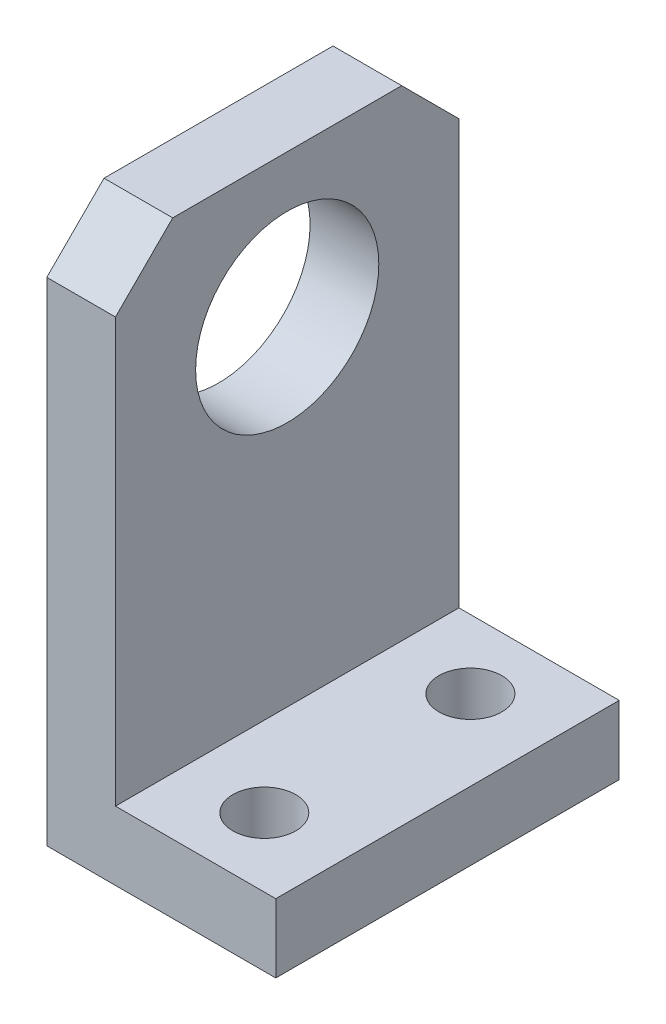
ISO-10303-21;
HEADER;
FILE_DESCRIPTION(('STEP AP214'),'2;1');
FILE_NAME('part.step','',(''),(''),'','','');
FILE_SCHEMA(('AUTOMOTIVE_DESIGN { 1 0 10303 214 1 1 1 1 }'));
ENDSEC;
DATA;
#1=APPLICATION_CONTEXT('core data for automotive mechanical design processes');
#2=APPLICATION_PROTOCOL_DEFINITION('international standard','automotive_design',2000,#1);
#3=PRODUCT_CONTEXT('',#1,'mechanical');
#4=PRODUCT('Part','Part','',(#3));
#5=PRODUCT_RELATED_PRODUCT_CATEGORY('part','',(#4));
#6=PRODUCT_DEFINITION_FORMATION('','',#4);
#7=PRODUCT_DEFINITION_CONTEXT('part definition',#1,'design');
#8=PRODUCT_DEFINITION('design','',#6,#7);
#9=PRODUCT_DEFINITION_SHAPE('','',#8);
#10=(LENGTH_UNIT() NAMED_UNIT(*) SI_UNIT(.MILLI.,.METRE.));
#11=(NAMED_UNIT(*) PLANE_ANGLE_UNIT() SI_UNIT($,.RADIAN.));
#12=(NAMED_UNIT(*) SI_UNIT($,.STERADIAN.) SOLID_ANGLE_UNIT());
#13=UNCERTAINTY_MEASURE_WITH_UNIT(LENGTH_MEASURE(1.E-05),#10,'distance_accuracy_value','');
#14=(GEOMETRIC_REPRESENTATION_CONTEXT(3) GLOBAL_UNCERTAINTY_ASSIGNED_CONTEXT((#13)) GLOBAL_UNIT_ASSIGNED_CONTEXT((#10,
#11,#12)) REPRESENTATION_CONTEXT('',''));
#15=CARTESIAN_POINT('',(0.,0.,0.));
#16=DIRECTION('',(0.,0.,1.));
#17=DIRECTION('',(1.,0.,0.));
#18=AXIS2_PLACEMENT_3D('',#15,#16,#17);
#19=CARTESIAN_POINT('',(13.,-24.,9.00000000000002));
#20=DIRECTION('',(0.,1.,0.));
#21=DIRECTION('',(0.,0.,1.));
#22=AXIS2_PLACEMENT_3D('',#19,#20,#21);
#23=CYLINDRICAL_SURFACE('',#22,2.75);
#24=CARTESIAN_POINT('',(13.,-24.,9.00000000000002));
#25=DIRECTION('',(0.,1.,0.));
#26=DIRECTION('',(0.,0.,1.));
#27=AXIS2_PLACEMENT_3D('',#24,#25,#26);
#28=CIRCLE('',#27,2.75);
#29=CARTESIAN_POINT('',(13.,-24.,11.75));
#30=VERTEX_POINT('',#29);
#31=EDGE_CURVE('E116',#30,#30,#28,.F.);
#32=ORIENTED_EDGE('',*,*,#31,.T.);
#33=EDGE_LOOP('',(#32));
#34=FACE_BOUND('',#33,.T.);
#35=CARTESIAN_POINT('',(13.,-18.,9.00000000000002));
#36=DIRECTION('',(0.,1.,0.));
#37=DIRECTION('',(0.,0.,1.));
#38=AXIS2_PLACEMENT_3D('',#35,#36,#37);
#39=CIRCLE('',#38,2.75);
#40=CARTESIAN_POINT('',(13.,-18.,11.75));
#41=VERTEX_POINT('',#40);
#42=EDGE_CURVE('E20',#41,#41,#39,.T.);
#43=ORIENTED_EDGE('',*,*,#42,.T.);
#44=EDGE_LOOP('',(#43));
#45=FACE_BOUND('',#44,.T.);
#46=ADVANCED_FACE('F17',(#34,#45),#23,.F.);
#47=CARTESIAN_POINT('',(13.,-24.,-9.00000000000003));
#48=DIRECTION('',(0.,1.,0.));
#49=DIRECTION('',(0.,0.,1.));
#50=AXIS2_PLACEMENT_3D('',#47,#48,#49);
#51=CYLINDRICAL_SURFACE('',#50,2.75);
#52=CARTESIAN_POINT('',(13.,-24.,-9.00000000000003));
#53=DIRECTION('',(0.,1.,0.));
#54=DIRECTION('',(0.,0.,1.));
#55=AXIS2_PLACEMENT_3D('',#52,#53,#54);
#56=CIRCLE('',#55,2.75);
#57=CARTESIAN_POINT('',(13.,-24.,-6.25000000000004));
#58=VERTEX_POINT('',#57);
#59=EDGE_CURVE('E97',#58,#58,#56,.F.);
#60=ORIENTED_EDGE('',*,*,#59,.T.);
#61=EDGE_LOOP('',(#60));
#62=FACE_BOUND('',#61,.T.);
#63=CARTESIAN_POINT('',(13.,-18.,-9.00000000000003));
#64=DIRECTION('',(0.,1.,0.));
#65=DIRECTION('',(0.,0.,1.));
#66=AXIS2_PLACEMENT_3D('',#63,#64,#65);
#67=CIRCLE('',#66,2.75);
#68=CARTESIAN_POINT('',(13.,-18.,-6.25000000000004));
#69=VERTEX_POINT('',#68);
#70=EDGE_CURVE('E117',#69,#69,#67,.T.);
#71=ORIENTED_EDGE('',*,*,#70,.T.);
#72=EDGE_LOOP('',(#71));
#73=FACE_BOUND('',#72,.T.);
#74=ADVANCED_FACE('F135',(#62,#73),#51,.F.);
#75=CARTESIAN_POINT('',(0.,-18.,0.));
#76=DIRECTION('',(0.,-1.,0.));
#77=DIRECTION('',(0.,0.,-1.));
#78=AXIS2_PLACEMENT_3D('',#75,#76,#77);
#79=PLANE('',#78);
#80=DIRECTION('',(1.,0.,0.));
#81=VECTOR('',#80,1.);
#82=CARTESIAN_POINT('',(6.,-18.,15.));
#83=LINE('',#82,#81);
#84=CARTESIAN_POINT('',(6.,-18.,15.));
#85=VERTEX_POINT('',#84);
#86=CARTESIAN_POINT('',(20.,-18.,15.));
#87=VERTEX_POINT('',#86);
#88=EDGE_CURVE('E201',#85,#87,#83,.T.);
#89=ORIENTED_EDGE('',*,*,#88,.T.);
#90=DIRECTION('',(0.,0.,-1.));
#91=VECTOR('',#90,1.);
#92=CARTESIAN_POINT('',(20.,-18.,-15.));
#93=LINE('',#92,#91);
#94=CARTESIAN_POINT('',(20.,-18.,-15.));
#95=VERTEX_POINT('',#94);
#96=EDGE_CURVE('E80',#95,#87,#93,.F.);
#97=ORIENTED_EDGE('',*,*,#96,.F.);
#98=DIRECTION('',(1.,0.,0.));
#99=VECTOR('',#98,1.);
#100=CARTESIAN_POINT('',(6.,-18.,-15.));
#101=LINE('',#100,#99);
#102=CARTESIAN_POINT('',(6.,-18.,-15.));
#103=VERTEX_POINT('',#102);
#104=EDGE_CURVE('E105',#95,#103,#101,.F.);
#105=ORIENTED_EDGE('',*,*,#104,.T.);
#106=DIRECTION('',(0.,0.,-1.));
#107=VECTOR('',#106,1.);
#108=CARTESIAN_POINT('',(6.,-18.,0.));
#109=LINE('',#108,#107);
#110=EDGE_CURVE('E114',#85,#103,#109,.T.);
#111=ORIENTED_EDGE('',*,*,#110,.F.);
#112=EDGE_LOOP('',(#89,#97,#105,#111));
#113=FACE_BOUND('',#112,.T.);
#114=ORIENTED_EDGE('',*,*,#70,.F.);
#115=EDGE_LOOP('',(#114));
#116=FACE_BOUND('',#115,.T.);
#117=ORIENTED_EDGE('',*,*,#42,.F.);
#118=EDGE_LOOP('',(#117));
#119=FACE_BOUND('',#118,.T.);
#120=ADVANCED_FACE('F133',(#113,#116,#119),#79,.F.);
#121=CARTESIAN_POINT('',(20.,-18.,-15.));
#122=DIRECTION('',(1.,0.,0.));
#123=DIRECTION('',(0.,0.,-1.));
#124=AXIS2_PLACEMENT_3D('',#121,#122,#123);
#125=PLANE('',#124);
#126=ORIENTED_EDGE('',*,*,#96,.T.);
#127=DIRECTION('',(0.,1.,0.));
#128=VECTOR('',#127,1.);
#129=CARTESIAN_POINT('',(20.,24.,15.));
#130=LINE('',#129,#128);
#131=CARTESIAN_POINT('',(20.,-24.,15.));
#132=VERTEX_POINT('',#131);
#133=EDGE_CURVE('E91',#87,#132,#130,.F.);
#134=ORIENTED_EDGE('',*,*,#133,.T.);
#135=DIRECTION('',(0.,0.,1.));
#136=VECTOR('',#135,1.);
#137=CARTESIAN_POINT('',(20.,-24.,15.));
#138=LINE('',#137,#136);
#139=CARTESIAN_POINT('',(20.,-24.,-15.));
#140=VERTEX_POINT('',#139);
#141=EDGE_CURVE('E86',#132,#140,#138,.F.);
#142=ORIENTED_EDGE('',*,*,#141,.T.);
#143=DIRECTION('',(0.,-1.,0.));
#144=VECTOR('',#143,1.);
#145=CARTESIAN_POINT('',(20.,24.,-15.));
#146=LINE('',#145,#144);
#147=EDGE_CURVE('E89',#140,#95,#146,.F.);
#148=ORIENTED_EDGE('',*,*,#147,.T.);
#149=EDGE_LOOP('',(#126,#134,#142,#148));
#150=FACE_BOUND('',#149,.T.);
#151=ADVANCED_FACE('F88',(#150),#125,.T.);
#152=CARTESIAN_POINT('',(6.,0.,0.));
#153=DIRECTION('',(1.,0.,0.));
#154=DIRECTION('',(0.,0.,-1.));
#155=AXIS2_PLACEMENT_3D('',#152,#153,#154);
#156=PLANE('',#155);
#157=DIRECTION('',(0.,-1.,0.));
#158=VECTOR('',#157,1.);
#159=CARTESIAN_POINT('',(6.,24.,-15.));
#160=LINE('',#159,#158);
#161=CARTESIAN_POINT('',(6.,19.,-15.));
#162=VERTEX_POINT('',#161);
#163=EDGE_CURVE('E183',#103,#162,#160,.F.);
#164=ORIENTED_EDGE('',*,*,#163,.T.);
#165=DIRECTION('',(0.,-0.707106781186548,-0.707106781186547));
#166=VECTOR('',#165,1.);
#167=CARTESIAN_POINT('',(6.,24.,-10.));
#168=LINE('',#167,#166);
#169=CARTESIAN_POINT('',(6.,24.,-10.));
#170=VERTEX_POINT('',#169);
#171=EDGE_CURVE('E187',#162,#170,#168,.F.);
#172=ORIENTED_EDGE('',*,*,#171,.T.);
#173=DIRECTION('',(0.,0.,-1.));
#174=VECTOR('',#173,1.);
#175=CARTESIAN_POINT('',(6.,24.,15.));
#176=LINE('',#175,#174);
#177=CARTESIAN_POINT('',(6.,24.,9.99999999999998));
#178=VERTEX_POINT('',#177);
#179=EDGE_CURVE('E217',#170,#178,#176,.F.);
#180=ORIENTED_EDGE('',*,*,#179,.T.);
#181=DIRECTION('',(0.,0.707106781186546,-0.707106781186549));
#182=VECTOR('',#181,1.);
#183=CARTESIAN_POINT('',(6.,19.,15.));
#184=LINE('',#183,#182);
#185=CARTESIAN_POINT('',(6.,19.,15.));
#186=VERTEX_POINT('',#185);
#187=EDGE_CURVE('E203',#178,#186,#184,.F.);
#188=ORIENTED_EDGE('',*,*,#187,.T.);
#189=DIRECTION('',(0.,1.,0.));
#190=VECTOR('',#189,1.);
#191=CARTESIAN_POINT('',(6.,24.,15.));
#192=LINE('',#191,#190);
#193=EDGE_CURVE('E122',#186,#85,#192,.F.);
#194=ORIENTED_EDGE('',*,*,#193,.T.);
#195=ORIENTED_EDGE('',*,*,#110,.T.);
#196=EDGE_LOOP('',(#164,#172,#180,#188,#194,#195));
#197=FACE_BOUND('',#196,.T.);
#198=CARTESIAN_POINT('',(6.,11.5,0.));
#199=DIRECTION('',(-1.,0.,0.));
#200=DIRECTION('',(0.,0.,1.));
#201=AXIS2_PLACEMENT_3D('',#198,#199,#200);
#202=CIRCLE('',#201,8.);
#203=CARTESIAN_POINT('',(6.,11.5,8.));
#204=VERTEX_POINT('',#203);
#205=EDGE_CURVE('E119',#204,#204,#202,.T.);
#206=ORIENTED_EDGE('',*,*,#205,.T.);
#207=EDGE_LOOP('',(#206));
#208=FACE_BOUND('',#207,.T.);
#209=ADVANCED_FACE('F142',(#197,#208),#156,.T.);
#210=CARTESIAN_POINT('',(6.,-24.,15.));
#211=DIRECTION('',(0.,1.,0.));
#212=DIRECTION('',(0.,0.,1.));
#213=AXIS2_PLACEMENT_3D('',#210,#211,#212);
#214=PLANE('',#213);
#215=DIRECTION('',(1.,0.,0.));
#216=VECTOR('',#215,1.);
#217=CARTESIAN_POINT('',(6.,-24.,-15.));
#218=LINE('',#217,#216);
#219=CARTESIAN_POINT('',(0.,-24.,-15.));
#220=VERTEX_POINT('',#219);
#221=EDGE_CURVE('E96',#220,#140,#218,.T.);
#222=ORIENTED_EDGE('',*,*,#221,.T.);
#223=ORIENTED_EDGE('',*,*,#141,.F.);
#224=DIRECTION('',(1.,0.,0.));
#225=VECTOR('',#224,1.);
#226=CARTESIAN_POINT('',(6.,-24.,15.));
#227=LINE('',#226,#225);
#228=CARTESIAN_POINT('',(0.,-24.,15.));
#229=VERTEX_POINT('',#228);
#230=EDGE_CURVE('E205',#132,#229,#227,.F.);
#231=ORIENTED_EDGE('',*,*,#230,.T.);
#232=DIRECTION('',(0.,0.,-1.));
#233=VECTOR('',#232,1.);
#234=CARTESIAN_POINT('',(0.,-24.,0.));
#235=LINE('',#234,#233);
#236=EDGE_CURVE('E110',#229,#220,#235,.T.);
#237=ORIENTED_EDGE('',*,*,#236,.T.);
#238=EDGE_LOOP('',(#222,#223,#231,#237));
#239=FACE_BOUND('',#238,.T.);
#240=ORIENTED_EDGE('',*,*,#59,.F.);
#241=EDGE_LOOP('',(#240));
#242=FACE_BOUND('',#241,.T.);
#243=ORIENTED_EDGE('',*,*,#31,.F.);
#244=EDGE_LOOP('',(#243));
#245=FACE_BOUND('',#244,.T.);
#246=ADVANCED_FACE('F108',(#239,#242,#245),#214,.F.);
#247=CARTESIAN_POINT('',(6.,24.,-15.));
#248=DIRECTION('',(0.,0.,1.));
#249=DIRECTION('',(0.,-1.,0.));
#250=AXIS2_PLACEMENT_3D('',#247,#248,#249);
#251=PLANE('',#250);
#252=DIRECTION('',(1.,0.,0.));
#253=VECTOR('',#252,1.);
#254=CARTESIAN_POINT('',(6.,19.,-15.));
#255=LINE('',#254,#253);
#256=CARTESIAN_POINT('',(0.,19.,-15.));
#257=VERTEX_POINT('',#256);
#258=EDGE_CURVE('E191',#257,#162,#255,.T.);
#259=ORIENTED_EDGE('',*,*,#258,.T.);
#260=ORIENTED_EDGE('',*,*,#163,.F.);
#261=ORIENTED_EDGE('',*,*,#104,.F.);
#262=ORIENTED_EDGE('',*,*,#147,.F.);
#263=ORIENTED_EDGE('',*,*,#221,.F.);
#264=DIRECTION('',(0.,1.,0.));
#265=VECTOR('',#264,1.);
#266=CARTESIAN_POINT('',(0.,0.,-15.));
#267=LINE('',#266,#265);
#268=EDGE_CURVE('E198',#220,#257,#267,.T.);
#269=ORIENTED_EDGE('',*,*,#268,.T.);
#270=EDGE_LOOP('',(#259,#260,#261,#262,#263,#269));
#271=FACE_BOUND('',#270,.T.);
#272=ADVANCED_FACE('F101',(#271),#251,.F.);
#273=CARTESIAN_POINT('',(6.,24.,-10.));
#274=DIRECTION('',(0.,-0.707106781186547,0.707106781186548));
#275=DIRECTION('',(0.,-0.707106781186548,-0.707106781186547));
#276=AXIS2_PLACEMENT_3D('',#273,#274,#275);
#277=PLANE('',#276);
#278=ORIENTED_EDGE('',*,*,#258,.F.);
#279=DIRECTION('',(0.,0.707106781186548,0.707106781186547));
#280=VECTOR('',#279,1.);
#281=CARTESIAN_POINT('',(0.,19.,-15.));
#282=LINE('',#281,#280);
#283=CARTESIAN_POINT('',(0.,24.,-10.));
#284=VERTEX_POINT('',#283);
#285=EDGE_CURVE('E224',#257,#284,#282,.T.);
#286=ORIENTED_EDGE('',*,*,#285,.T.);
#287=DIRECTION('',(1.,0.,0.));
#288=VECTOR('',#287,1.);
#289=CARTESIAN_POINT('',(6.,24.,-10.));
#290=LINE('',#289,#288);
#291=EDGE_CURVE('E196',#284,#170,#290,.T.);
#292=ORIENTED_EDGE('',*,*,#291,.T.);
#293=ORIENTED_EDGE('',*,*,#171,.F.);
#294=EDGE_LOOP('',(#278,#286,#292,#293));
#295=FACE_BOUND('',#294,.T.);
#296=ADVANCED_FACE('F169',(#295),#277,.F.);
#297=CARTESIAN_POINT('',(6.,24.,15.));
#298=DIRECTION('',(0.,-1.,0.));
#299=DIRECTION('',(0.,0.,-1.));
#300=AXIS2_PLACEMENT_3D('',#297,#298,#299);
#301=PLANE('',#300);
#302=DIRECTION('',(1.,0.,0.));
#303=VECTOR('',#302,1.);
#304=CARTESIAN_POINT('',(6.,24.,9.99999999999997));
#305=LINE('',#304,#303);
#306=CARTESIAN_POINT('',(0.,24.,9.99999999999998));
#307=VERTEX_POINT('',#306);
#308=EDGE_CURVE('E214',#307,#178,#305,.T.);
#309=ORIENTED_EDGE('',*,*,#308,.T.);
#310=ORIENTED_EDGE('',*,*,#179,.F.);
#311=ORIENTED_EDGE('',*,*,#291,.F.);
#312=DIRECTION('',(0.,0.,-1.));
#313=VECTOR('',#312,1.);
#314=CARTESIAN_POINT('',(0.,24.,0.));
#315=LINE('',#314,#313);
#316=EDGE_CURVE('E222',#284,#307,#315,.F.);
#317=ORIENTED_EDGE('',*,*,#316,.T.);
#318=EDGE_LOOP('',(#309,#310,#311,#317));
#319=FACE_BOUND('',#318,.T.);
#320=ADVANCED_FACE('F165',(#319),#301,.F.);
#321=CARTESIAN_POINT('',(6.,19.,15.));
#322=DIRECTION('',(0.,-0.707106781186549,-0.707106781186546));
#323=DIRECTION('',(0.,0.707106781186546,-0.707106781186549));
#324=AXIS2_PLACEMENT_3D('',#321,#322,#323);
#325=PLANE('',#324);
#326=ORIENTED_EDGE('',*,*,#308,.F.);
#327=DIRECTION('',(0.,-0.707106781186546,0.707106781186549));
#328=VECTOR('',#327,1.);
#329=CARTESIAN_POINT('',(0.,24.,9.99999999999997));
#330=LINE('',#329,#328);
#331=CARTESIAN_POINT('',(0.,19.,15.));
#332=VERTEX_POINT('',#331);
#333=EDGE_CURVE('E223',#307,#332,#330,.T.);
#334=ORIENTED_EDGE('',*,*,#333,.T.);
#335=DIRECTION('',(1.,0.,0.));
#336=VECTOR('',#335,1.);
#337=CARTESIAN_POINT('',(6.,19.,15.));
#338=LINE('',#337,#336);
#339=EDGE_CURVE('E35',#332,#186,#338,.T.);
#340=ORIENTED_EDGE('',*,*,#339,.T.);
#341=ORIENTED_EDGE('',*,*,#187,.F.);
#342=EDGE_LOOP('',(#326,#334,#340,#341));
#343=FACE_BOUND('',#342,.T.);
#344=ADVANCED_FACE('F162',(#343),#325,.F.);
#345=CARTESIAN_POINT('',(6.,24.,15.));
#346=DIRECTION('',(0.,0.,-1.));
#347=DIRECTION('',(0.,1.,0.));
#348=AXIS2_PLACEMENT_3D('',#345,#346,#347);
#349=PLANE('',#348);
#350=ORIENTED_EDGE('',*,*,#339,.F.);
#351=DIRECTION('',(0.,1.,0.));
#352=VECTOR('',#351,1.);
#353=CARTESIAN_POINT('',(0.,0.,15.));
#354=LINE('',#353,#352);
#355=EDGE_CURVE('E26',#332,#229,#354,.F.);
#356=ORIENTED_EDGE('',*,*,#355,.T.);
#357=ORIENTED_EDGE('',*,*,#230,.F.);
#358=ORIENTED_EDGE('',*,*,#133,.F.);
#359=ORIENTED_EDGE('',*,*,#88,.F.);
#360=ORIENTED_EDGE('',*,*,#193,.F.);
#361=EDGE_LOOP('',(#350,#356,#357,#358,#359,#360));
#362=FACE_BOUND('',#361,.T.);
#363=ADVANCED_FACE('F154',(#362),#349,.F.);
#364=CARTESIAN_POINT('',(6.,11.5,0.));
#365=DIRECTION('',(-1.,0.,0.));
#366=DIRECTION('',(0.,0.,1.));
#367=AXIS2_PLACEMENT_3D('',#364,#365,#366);
#368=CYLINDRICAL_SURFACE('',#367,8.);
#369=CARTESIAN_POINT('',(0.,11.5,0.));
#370=DIRECTION('',(-1.,0.,0.));
#371=DIRECTION('',(0.,0.,1.));
#372=AXIS2_PLACEMENT_3D('',#369,#370,#371);
#373=CIRCLE('',#372,8.);
#374=CARTESIAN_POINT('',(0.,11.5,8.));
#375=VERTEX_POINT('',#374);
#376=EDGE_CURVE('E11',#375,#375,#373,.T.);
#377=ORIENTED_EDGE('',*,*,#376,.T.);
#378=EDGE_LOOP('',(#377));
#379=FACE_BOUND('',#378,.T.);
#380=ORIENTED_EDGE('',*,*,#205,.F.);
#381=EDGE_LOOP('',(#380));
#382=FACE_BOUND('',#381,.T.);
#383=ADVANCED_FACE('F148',(#379,#382),#368,.F.);
#384=CARTESIAN_POINT('',(0.,0.,0.));
#385=DIRECTION('',(1.,0.,0.));
#386=DIRECTION('',(0.,0.,-1.));
#387=AXIS2_PLACEMENT_3D('',#384,#385,#386);
#388=PLANE('',#387);
#389=ORIENTED_EDGE('',*,*,#376,.F.);
#390=EDGE_LOOP('',(#389));
#391=FACE_BOUND('',#390,.T.);
#392=ORIENTED_EDGE('',*,*,#333,.F.);
#393=ORIENTED_EDGE('',*,*,#316,.F.);
#394=ORIENTED_EDGE('',*,*,#285,.F.);
#395=ORIENTED_EDGE('',*,*,#268,.F.);
#396=ORIENTED_EDGE('',*,*,#236,.F.);
#397=ORIENTED_EDGE('',*,*,#355,.F.);
#398=EDGE_LOOP('',(#392,#393,#394,#395,#396,#397));
#399=FACE_BOUND('',#398,.T.);
#400=ADVANCED_FACE('F146',(#391,#399),#388,.F.);
#401=CLOSED_SHELL('',(#46,#74,#120,#151,#209,#246,#272,#296,#320,#344,#363,#383,#400));
#402=MANIFOLD_SOLID_BREP('B1',#401);
#403=ADVANCED_BREP_SHAPE_REPRESENTATION('',(#18,#402),#14);
#404=SHAPE_DEFINITION_REPRESENTATION(#9,#403);
ENDSEC;
END-ISO-10303-21;
